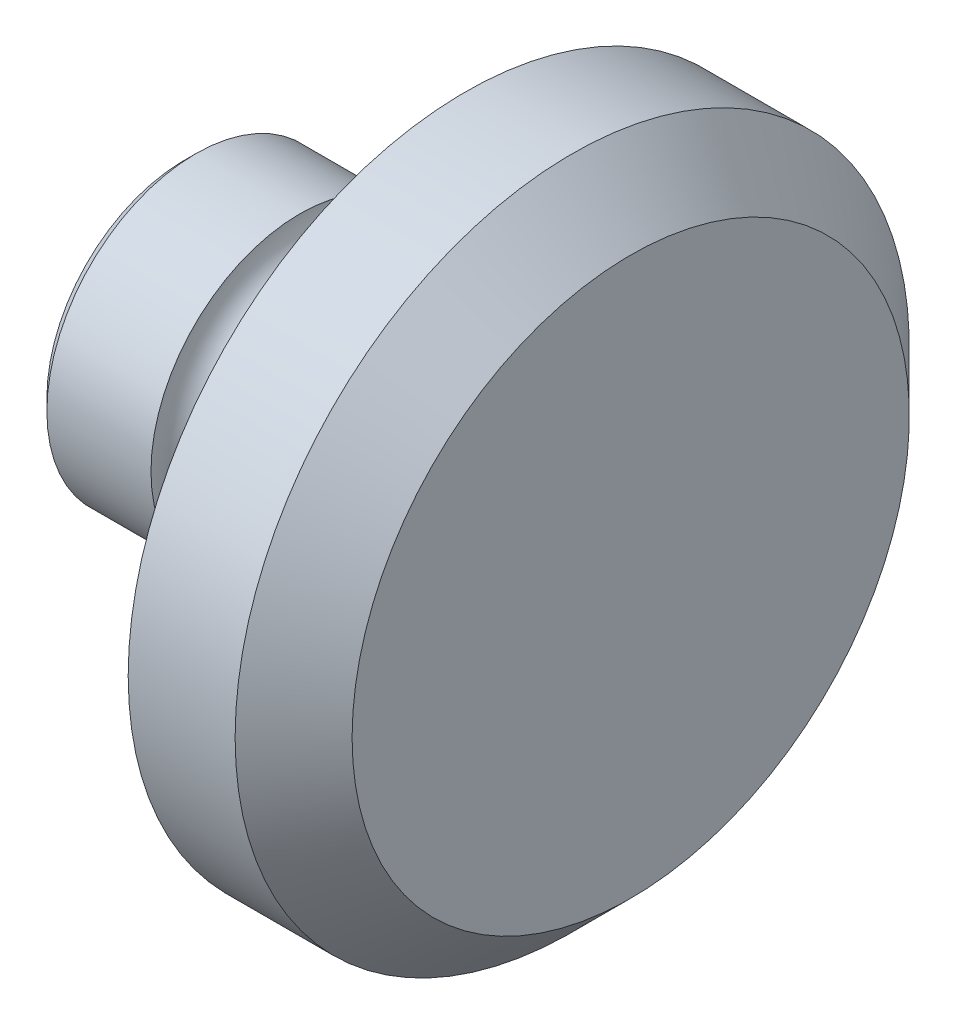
ISO-10303-21;
HEADER;
FILE_DESCRIPTION(('STEP AP214'),'2;1');
FILE_NAME('part.step','',(''),(''),'','','');
FILE_SCHEMA(('AUTOMOTIVE_DESIGN { 1 0 10303 214 1 1 1 1 }'));
ENDSEC;
DATA;
#1=APPLICATION_CONTEXT('core data for automotive mechanical design processes');
#2=APPLICATION_PROTOCOL_DEFINITION('international standard','automotive_design',2000,#1);
#3=PRODUCT_CONTEXT('',#1,'mechanical');
#4=PRODUCT('Part','Part','',(#3));
#5=PRODUCT_RELATED_PRODUCT_CATEGORY('part','',(#4));
#6=PRODUCT_DEFINITION_FORMATION('','',#4);
#7=PRODUCT_DEFINITION_CONTEXT('part definition',#1,'design');
#8=PRODUCT_DEFINITION('design','',#6,#7);
#9=PRODUCT_DEFINITION_SHAPE('','',#8);
#10=(LENGTH_UNIT() NAMED_UNIT(*) SI_UNIT(.MILLI.,.METRE.));
#11=(NAMED_UNIT(*) PLANE_ANGLE_UNIT() SI_UNIT($,.RADIAN.));
#12=(NAMED_UNIT(*) SI_UNIT($,.STERADIAN.) SOLID_ANGLE_UNIT());
#13=UNCERTAINTY_MEASURE_WITH_UNIT(LENGTH_MEASURE(1.E-05),#10,'distance_accuracy_value','');
#14=(GEOMETRIC_REPRESENTATION_CONTEXT(3) GLOBAL_UNCERTAINTY_ASSIGNED_CONTEXT((#13)) GLOBAL_UNIT_ASSIGNED_CONTEXT((#10,
#11,#12)) REPRESENTATION_CONTEXT('',''));
#15=CARTESIAN_POINT('',(0.,0.,0.));
#16=DIRECTION('',(0.,0.,1.));
#17=DIRECTION('',(1.,0.,0.));
#18=AXIS2_PLACEMENT_3D('',#15,#16,#17);
#19=CARTESIAN_POINT('',(-22.4645215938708,8.29289321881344,0.));
#20=DIRECTION('',(1.,0.,0.));
#21=DIRECTION('',(0.,0.,-1.));
#22=AXIS2_PLACEMENT_3D('',#19,#20,#21);
#23=PLANE('',#22);
#24=CARTESIAN_POINT('',(-22.4645215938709,0.,0.));
#25=DIRECTION('',(-1.,0.,0.));
#26=DIRECTION('',(0.,0.,1.));
#27=AXIS2_PLACEMENT_3D('',#24,#25,#26);
#28=CIRCLE('',#27,8.29289321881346);
#29=CARTESIAN_POINT('',(-22.4645215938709,0.,8.29289321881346));
#30=VERTEX_POINT('',#29);
#31=EDGE_CURVE('E75',#30,#30,#28,.T.);
#32=ORIENTED_EDGE('',*,*,#31,.T.);
#33=EDGE_LOOP('',(#32));
#34=FACE_BOUND('',#33,.T.);
#35=ADVANCED_FACE('F38',(#34),#23,.F.);
#36=CARTESIAN_POINT('',(4.53547840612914,16.842937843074,0.));
#37=DIRECTION('',(-1.,0.,0.));
#38=DIRECTION('',(0.,0.,1.));
#39=AXIS2_PLACEMENT_3D('',#36,#37,#38);
#40=PLANE('',#39);
#41=CARTESIAN_POINT('',(4.53547840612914,0.,0.));
#42=DIRECTION('',(-1.,0.,0.));
#43=DIRECTION('',(0.,0.,1.));
#44=AXIS2_PLACEMENT_3D('',#41,#42,#43);
#45=CIRCLE('',#44,16.842937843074);
#46=CARTESIAN_POINT('',(4.53547840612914,0.,16.842937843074));
#47=VERTEX_POINT('',#46);
#48=EDGE_CURVE('E10',#47,#47,#45,.T.);
#49=ORIENTED_EDGE('',*,*,#48,.F.);
#50=EDGE_LOOP('',(#49));
#51=FACE_BOUND('',#50,.T.);
#52=ADVANCED_FACE('F119',(#51),#40,.F.);
#53=CARTESIAN_POINT('',(4.53547840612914,0.,0.));
#54=DIRECTION('',(-1.,0.,0.));
#55=DIRECTION('',(0.,0.,1.));
#56=AXIS2_PLACEMENT_3D('',#53,#54,#55);
#57=CONICAL_SURFACE('',#56,16.842937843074,0.78539816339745);
#58=CARTESIAN_POINT('',(0.999944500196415,0.,0.));
#59=DIRECTION('',(-1.,0.,0.));
#60=DIRECTION('',(0.,0.,1.));
#61=AXIS2_PLACEMENT_3D('',#58,#59,#60);
#62=CIRCLE('',#61,20.3784717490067);
#63=CARTESIAN_POINT('',(0.999944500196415,0.,20.3784717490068));
#64=VERTEX_POINT('',#63);
#65=EDGE_CURVE('E45',#64,#64,#62,.T.);
#66=ORIENTED_EDGE('',*,*,#65,.F.);
#67=EDGE_LOOP('',(#66));
#68=FACE_BOUND('',#67,.T.);
#69=ORIENTED_EDGE('',*,*,#48,.T.);
#70=EDGE_LOOP('',(#69));
#71=FACE_BOUND('',#70,.T.);
#72=ADVANCED_FACE('F114',(#68,#71),#57,.T.);
#73=CARTESIAN_POINT('',(-26.4210462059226,0.,0.));
#74=DIRECTION('',(-1.,0.,0.));
#75=DIRECTION('',(0.,0.,1.));
#76=AXIS2_PLACEMENT_3D('',#73,#74,#75);
#77=CYLINDRICAL_SURFACE('',#76,20.3784717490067);
#78=CARTESIAN_POINT('',(-5.46452159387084,0.,0.));
#79=DIRECTION('',(-1.,0.,0.));
#80=DIRECTION('',(0.,0.,1.));
#81=AXIS2_PLACEMENT_3D('',#78,#79,#80);
#82=CIRCLE('',#81,20.3784717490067);
#83=CARTESIAN_POINT('',(-5.46452159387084,0.,20.3784717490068));
#84=VERTEX_POINT('',#83);
#85=EDGE_CURVE('E51',#84,#84,#82,.T.);
#86=ORIENTED_EDGE('',*,*,#85,.F.);
#87=EDGE_LOOP('',(#86));
#88=FACE_BOUND('',#87,.T.);
#89=ORIENTED_EDGE('',*,*,#65,.T.);
#90=EDGE_LOOP('',(#89));
#91=FACE_BOUND('',#90,.T.);
#92=ADVANCED_FACE('F109',(#88,#91),#77,.T.);
#93=CARTESIAN_POINT('',(-5.46452159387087,8.99999999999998,0.));
#94=DIRECTION('',(1.,0.,0.));
#95=DIRECTION('',(0.,0.,-1.));
#96=AXIS2_PLACEMENT_3D('',#93,#94,#95);
#97=PLANE('',#96);
#98=CARTESIAN_POINT('',(-5.46452159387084,0.,0.));
#99=DIRECTION('',(-1.,0.,0.));
#100=DIRECTION('',(0.,0.,1.));
#101=AXIS2_PLACEMENT_3D('',#98,#99,#100);
#102=CIRCLE('',#101,9.);
#103=CARTESIAN_POINT('',(-5.46452159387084,0.,9.00000000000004));
#104=VERTEX_POINT('',#103);
#105=EDGE_CURVE('E57',#104,#104,#102,.T.);
#106=ORIENTED_EDGE('',*,*,#105,.F.);
#107=EDGE_LOOP('',(#106));
#108=FACE_BOUND('',#107,.T.);
#109=ORIENTED_EDGE('',*,*,#85,.T.);
#110=EDGE_LOOP('',(#109));
#111=FACE_BOUND('',#110,.T.);
#112=ADVANCED_FACE('F103',(#108,#111),#97,.F.);
#113=CARTESIAN_POINT('',(-26.4210462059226,0.,0.));
#114=DIRECTION('',(-1.,0.,0.));
#115=DIRECTION('',(0.,0.,1.));
#116=AXIS2_PLACEMENT_3D('',#113,#114,#115);
#117=CYLINDRICAL_SURFACE('',#116,9.);
#118=CARTESIAN_POINT('',(-11.4645215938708,0.,0.));
#119=DIRECTION('',(-1.,0.,0.));
#120=DIRECTION('',(0.,0.,1.));
#121=AXIS2_PLACEMENT_3D('',#118,#119,#120);
#122=CIRCLE('',#121,9.);
#123=CARTESIAN_POINT('',(-11.4645215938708,0.,9.00000000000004));
#124=VERTEX_POINT('',#123);
#125=EDGE_CURVE('E63',#124,#124,#122,.T.);
#126=ORIENTED_EDGE('',*,*,#125,.F.);
#127=EDGE_LOOP('',(#126));
#128=FACE_BOUND('',#127,.T.);
#129=ORIENTED_EDGE('',*,*,#105,.T.);
#130=EDGE_LOOP('',(#129));
#131=FACE_BOUND('',#130,.T.);
#132=ADVANCED_FACE('F97',(#128,#131),#117,.T.);
#133=CARTESIAN_POINT('',(-13.4645215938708,0.,0.));
#134=DIRECTION('',(-1.,0.,0.));
#135=DIRECTION('',(0.,0.,1.));
#136=AXIS2_PLACEMENT_3D('',#133,#134,#135);
#137=TOROIDAL_SURFACE('',#136,9.,2.);
#138=CARTESIAN_POINT('',(-15.4645215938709,-1.11022302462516E-13,0.));
#139=DIRECTION('',(-1.,0.,0.));
#140=DIRECTION('',(0.,0.,1.));
#141=AXIS2_PLACEMENT_3D('',#138,#139,#140);
#142=CIRCLE('',#141,9.);
#143=CARTESIAN_POINT('',(-15.4645215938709,-1.10023101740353E-13,9.00000000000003));
#144=VERTEX_POINT('',#143);
#145=EDGE_CURVE('E67',#144,#144,#142,.T.);
#146=ORIENTED_EDGE('',*,*,#145,.F.);
#147=EDGE_LOOP('',(#146));
#148=FACE_BOUND('',#147,.T.);
#149=ORIENTED_EDGE('',*,*,#125,.T.);
#150=EDGE_LOOP('',(#149));
#151=FACE_BOUND('',#150,.T.);
#152=ADVANCED_FACE('F91',(#148,#151),#137,.F.);
#153=CARTESIAN_POINT('',(-26.4210462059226,0.,0.));
#154=DIRECTION('',(-1.,0.,0.));
#155=DIRECTION('',(0.,0.,1.));
#156=AXIS2_PLACEMENT_3D('',#153,#154,#155);
#157=CYLINDRICAL_SURFACE('',#156,9.);
#158=CARTESIAN_POINT('',(-21.7574148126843,0.,0.));
#159=DIRECTION('',(-1.,0.,0.));
#160=DIRECTION('',(0.,0.,1.));
#161=AXIS2_PLACEMENT_3D('',#158,#159,#160);
#162=CIRCLE('',#161,9.);
#163=CARTESIAN_POINT('',(-21.7574148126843,0.,9.00000000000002));
#164=VERTEX_POINT('',#163);
#165=EDGE_CURVE('E71',#164,#164,#162,.T.);
#166=ORIENTED_EDGE('',*,*,#165,.F.);
#167=EDGE_LOOP('',(#166));
#168=FACE_BOUND('',#167,.T.);
#169=ORIENTED_EDGE('',*,*,#145,.T.);
#170=EDGE_LOOP('',(#169));
#171=FACE_BOUND('',#170,.T.);
#172=ADVANCED_FACE('F85',(#168,#171),#157,.T.);
#173=CARTESIAN_POINT('',(-21.7574148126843,0.,0.));
#174=DIRECTION('',(1.,0.,0.));
#175=DIRECTION('',(0.,0.,-1.));
#176=AXIS2_PLACEMENT_3D('',#173,#174,#175);
#177=CONICAL_SURFACE('',#176,9.,0.785398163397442);
#178=ORIENTED_EDGE('',*,*,#31,.F.);
#179=EDGE_LOOP('',(#178));
#180=FACE_BOUND('',#179,.T.);
#181=ORIENTED_EDGE('',*,*,#165,.T.);
#182=EDGE_LOOP('',(#181));
#183=FACE_BOUND('',#182,.T.);
#184=ADVANCED_FACE('F82',(#180,#183),#177,.T.);
#185=CLOSED_SHELL('',(#35,#52,#72,#92,#112,#132,#152,#172,#184));
#186=MANIFOLD_SOLID_BREP('B2',#185);
#187=ADVANCED_BREP_SHAPE_REPRESENTATION('',(#18,#186),#14);
#188=SHAPE_DEFINITION_REPRESENTATION(#9,#187);
ENDSEC;
END-ISO-10303-21;
